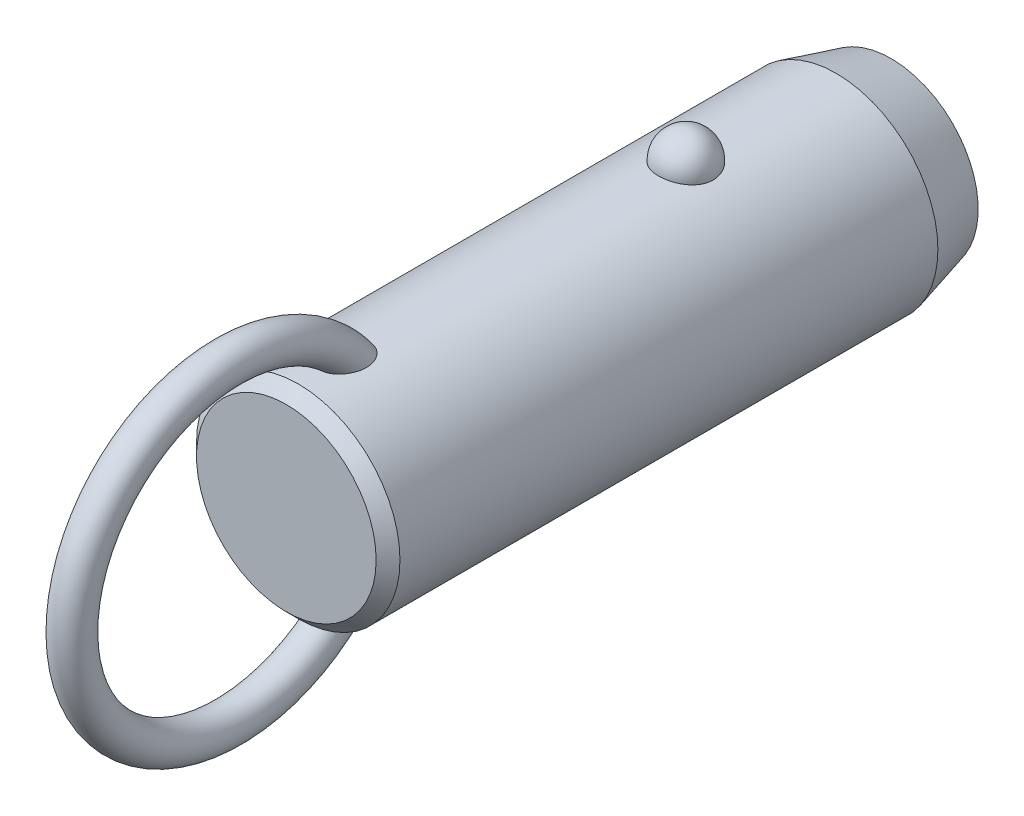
ISO-10303-21;
HEADER;
FILE_DESCRIPTION(('STEP AP214'),'2;1');
FILE_NAME('part.step','',(''),(''),'','','');
FILE_SCHEMA(('AUTOMOTIVE_DESIGN { 1 0 10303 214 1 1 1 1 }'));
ENDSEC;
DATA;
#1=APPLICATION_CONTEXT('core data for automotive mechanical design processes');
#2=APPLICATION_PROTOCOL_DEFINITION('international standard','automotive_design',2000,#1);
#3=PRODUCT_CONTEXT('',#1,'mechanical');
#4=PRODUCT('Part','Part','',(#3));
#5=PRODUCT_RELATED_PRODUCT_CATEGORY('part','',(#4));
#6=PRODUCT_DEFINITION_FORMATION('','',#4);
#7=PRODUCT_DEFINITION_CONTEXT('part definition',#1,'design');
#8=PRODUCT_DEFINITION('design','',#6,#7);
#9=PRODUCT_DEFINITION_SHAPE('','',#8);
#10=(LENGTH_UNIT() NAMED_UNIT(*) SI_UNIT(.MILLI.,.METRE.));
#11=(NAMED_UNIT(*) PLANE_ANGLE_UNIT() SI_UNIT($,.RADIAN.));
#12=(NAMED_UNIT(*) SI_UNIT($,.STERADIAN.) SOLID_ANGLE_UNIT());
#13=UNCERTAINTY_MEASURE_WITH_UNIT(LENGTH_MEASURE(1.E-05),#10,'distance_accuracy_value','');
#14=(GEOMETRIC_REPRESENTATION_CONTEXT(3) GLOBAL_UNCERTAINTY_ASSIGNED_CONTEXT((#13)) GLOBAL_UNIT_ASSIGNED_CONTEXT((#10,
#11,#12)) REPRESENTATION_CONTEXT('',''));
#15=CARTESIAN_POINT('',(0.,0.,0.));
#16=DIRECTION('',(0.,0.,1.));
#17=DIRECTION('',(1.,0.,0.));
#18=AXIS2_PLACEMENT_3D('',#15,#16,#17);
#19=CARTESIAN_POINT('',(0.,0.,27.9));
#20=DIRECTION('',(0.,0.,-1.));
#21=DIRECTION('',(-1.,0.,0.));
#22=AXIS2_PLACEMENT_3D('',#19,#20,#21);
#23=CYLINDRICAL_SURFACE('',#22,11.1);
#24=CARTESIAN_POINT('',(2.9724815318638,10.6945945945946,-3.00000000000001));
#25=CARTESIAN_POINT('',(2.9724783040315,10.6945972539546,-2.8322505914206));
#26=CARTESIAN_POINT('',(2.95876598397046,10.6984356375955,-2.66445972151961));
#27=CARTESIAN_POINT('',(2.90424529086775,10.7133624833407,-2.3336238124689));
#28=CARTESIAN_POINT('',(2.8634252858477,10.7244540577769,-2.17058084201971));
#29=CARTESIAN_POINT('',(2.75573657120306,10.7526272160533,-1.85396767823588));
#30=CARTESIAN_POINT('',(2.68887937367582,10.7697061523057,-1.70039333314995));
#31=CARTESIAN_POINT('',(2.53079696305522,10.8079438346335,-1.4069159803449));
#32=CARTESIAN_POINT('',(2.43957264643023,10.8291024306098,-1.26701246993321));
#33=CARTESIAN_POINT('',(2.23458150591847,10.8732541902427,-1.00409565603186));
#34=CARTESIAN_POINT('',(2.12071295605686,10.8962553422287,-0.88116297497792));
#35=CARTESIAN_POINT('',(1.87365402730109,10.9414421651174,-0.656352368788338));
#36=CARTESIAN_POINT('',(1.74046358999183,10.9636278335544,-0.554474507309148));
#37=CARTESIAN_POINT('',(1.45872188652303,11.0046495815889,-0.374872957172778));
#38=CARTESIAN_POINT('',(1.31021276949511,11.0234944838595,-0.297085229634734));
#39=CARTESIAN_POINT('',(1.00170030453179,11.0557957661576,-0.167529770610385));
#40=CARTESIAN_POINT('',(0.841698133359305,11.0692526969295,-0.115759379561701));
#41=CARTESIAN_POINT('',(0.51760779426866,11.0890932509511,-0.040392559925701));
#42=CARTESIAN_POINT('',(0.353633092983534,11.0955916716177,-0.0163383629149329));
#43=CARTESIAN_POINT('',(0.0238420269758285,11.1011989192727,0.0044517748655));
#44=CARTESIAN_POINT('',(-0.141974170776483,11.1003084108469,0.00119017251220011));
#45=CARTESIAN_POINT('',(-0.468405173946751,11.0912990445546,-0.0323233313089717));
#46=CARTESIAN_POINT('',(-0.629059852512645,11.0832767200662,-0.0622147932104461));
#47=CARTESIAN_POINT('',(-0.942937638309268,11.0609962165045,-0.147645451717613));
#48=CARTESIAN_POINT('',(-1.09616062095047,11.0467379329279,-0.20318507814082));
#49=CARTESIAN_POINT('',(-1.39181061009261,11.0134071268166,-0.338752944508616));
#50=CARTESIAN_POINT('',(-1.53417383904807,10.9943086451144,-0.418913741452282));
#51=CARTESIAN_POINT('',(-1.80342160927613,10.9533667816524,-0.601448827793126));
#52=CARTESIAN_POINT('',(-1.9303046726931,10.9315231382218,-0.703825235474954));
#53=CARTESIAN_POINT('',(-2.16747598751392,10.887005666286,-0.93009164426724));
#54=CARTESIAN_POINT('',(-2.27742774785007,10.8643239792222,-1.05433291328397));
#55=CARTESIAN_POINT('',(-2.47517316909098,10.8209886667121,-1.31966633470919));
#56=CARTESIAN_POINT('',(-2.56296538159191,10.8003351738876,-1.46075958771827));
#57=CARTESIAN_POINT('',(-2.71500300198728,10.7631304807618,-1.75753646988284));
#58=CARTESIAN_POINT('',(-2.77898901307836,10.7466250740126,-1.91335887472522));
#59=CARTESIAN_POINT('',(-2.88046189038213,10.7198747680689,-2.23391529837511));
#60=CARTESIAN_POINT('',(-2.91794947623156,10.709629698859,-2.3986490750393));
#61=CARTESIAN_POINT('',(-2.96537819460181,10.6965949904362,-2.73165170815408));
#62=CARTESIAN_POINT('',(-2.97542891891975,10.693775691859,-2.89990378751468));
#63=CARTESIAN_POINT('',(-2.96804271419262,10.6958279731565,-3.23575286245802));
#64=CARTESIAN_POINT('',(-2.95060646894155,10.7006993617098,-3.4033498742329));
#65=CARTESIAN_POINT('',(-2.88883358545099,10.71753912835,-3.73233906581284));
#66=CARTESIAN_POINT('',(-2.84462026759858,10.7294749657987,-3.89375610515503));
#67=CARTESIAN_POINT('',(-2.73050447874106,10.7590797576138,-4.20667949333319));
#68=CARTESIAN_POINT('',(-2.66060103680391,10.7767489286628,-4.35818546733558));
#69=CARTESIAN_POINT('',(-2.49642559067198,10.8159599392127,-4.64785421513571));
#70=CARTESIAN_POINT('',(-2.40203047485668,10.8375211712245,-4.78594458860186));
#71=CARTESIAN_POINT('',(-2.19143488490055,10.8820570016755,-5.04410382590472));
#72=CARTESIAN_POINT('',(-2.07523364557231,10.9050316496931,-5.16417205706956));
#73=CARTESIAN_POINT('',(-1.82361254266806,10.9499219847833,-5.3833483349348));
#74=CARTESIAN_POINT('',(-1.68812945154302,10.9718338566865,-5.48238464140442));
#75=CARTESIAN_POINT('',(-1.40191298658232,11.0120611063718,-5.65618873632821));
#76=CARTESIAN_POINT('',(-1.25118062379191,11.0303767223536,-5.73095813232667));
#77=CARTESIAN_POINT('',(-0.940570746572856,11.0611653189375,-5.85334725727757));
#78=CARTESIAN_POINT('',(-0.780821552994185,11.0737044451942,-5.90127578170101));
#79=CARTESIAN_POINT('',(-0.455204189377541,11.0918598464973,-5.9699297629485));
#80=CARTESIAN_POINT('',(-0.289336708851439,11.0974768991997,-5.99065827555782));
#81=CARTESIAN_POINT('',(0.0406846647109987,11.1011307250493,-6.00418773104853));
#82=CARTESIAN_POINT('',(0.204817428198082,11.099299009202,-5.99747318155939));
#83=CARTESIAN_POINT('',(0.5295530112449,11.088551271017,-5.95740317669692));
#84=CARTESIAN_POINT('',(0.690155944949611,11.0796354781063,-5.92404858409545));
#85=CARTESIAN_POINT('',(1.0027760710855,11.0557204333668,-5.83180084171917));
#86=CARTESIAN_POINT('',(1.15482001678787,11.0407414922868,-5.7729929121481));
#87=CARTESIAN_POINT('',(1.44678373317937,11.0062913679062,-5.63147366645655));
#88=CARTESIAN_POINT('',(1.58670279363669,10.9868199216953,-5.54876095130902));
#89=CARTESIAN_POINT('',(1.8527023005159,10.9451315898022,-5.36027644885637));
#90=CARTESIAN_POINT('',(1.97855158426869,10.9228788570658,-5.25418644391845));
#91=CARTESIAN_POINT('',(2.21080872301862,10.8782509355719,-5.02251354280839));
#92=CARTESIAN_POINT('',(2.31721312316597,10.8558757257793,-4.89692718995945));
#93=CARTESIAN_POINT('',(2.50945517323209,10.8130715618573,-4.62745408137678));
#94=CARTESIAN_POINT('',(2.59493284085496,10.7926798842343,-4.48330448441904));
#95=CARTESIAN_POINT('',(2.740862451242,10.7565495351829,-4.18236358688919));
#96=CARTESIAN_POINT('',(2.80132490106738,10.7408089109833,-4.02557762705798));
#97=CARTESIAN_POINT('',(2.88959070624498,10.7173718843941,-3.72475308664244));
#98=CARTESIAN_POINT('',(2.92062102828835,10.7088950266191,-3.58171216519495));
#99=CARTESIAN_POINT('',(2.96206765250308,10.6975052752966,-3.29245795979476));
#100=CARTESIAN_POINT('',(2.97248434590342,10.6945922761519,-3.14624473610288));
#101=CARTESIAN_POINT('',(2.9724815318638,10.6945945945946,-3.00000000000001));
#102=B_SPLINE_CURVE_WITH_KNOTS('',3,(#24,#25,#26,#27,#28,#29,#30,#31,#32,#33,#34,#35,#36,#37,
#38,#39,#40,#41,#42,#43,#44,#45,#46,#47,#48,#49,#50,#51,#52,#53,#54,#55,#56,#57,#58,#59,#60,#61,
#62,#63,#64,#65,#66,#67,#68,#69,#70,#71,#72,#73,#74,#75,#76,#77,#78,#79,#80,#81,#82,#83,#84,#85,
#86,#87,#88,#89,#90,#91,#92,#93,#94,#95,#96,#97,#98,#99,#100,#101),.UNSPECIFIED.,.T.,.F.,(4,2,2,
2,2,2,2,2,2,2,2,2,2,2,2,2,2,2,2,2,2,2,2,2,2,2,2,2,2,2,2,2,2,2,2,2,2,2,4),(0.,0.502722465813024,
1.00566079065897,1.5083769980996,2.01107471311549,2.51608392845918,3.02109467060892,
3.52475118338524,4.02835620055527,4.52351860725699,5.0186364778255,5.50715297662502,
5.99567766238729,6.48688002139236,6.97812923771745,7.47814366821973,7.97819077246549,
8.48353712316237,8.98886974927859,9.49218093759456,9.99547960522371,10.4964777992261,
10.997494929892,11.5010810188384,12.0046847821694,12.5099796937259,13.0152411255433,
13.5145635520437,14.0138298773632,14.5043200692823,14.9947943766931,15.4836390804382,
15.9725123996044,16.4685040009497,16.9645836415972,17.4686765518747,17.972557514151,
18.410841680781,18.849117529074),.UNSPECIFIED.);
#103=CARTESIAN_POINT('',(2.9724815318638,10.6945945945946,-3.00000000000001));
#104=VERTEX_POINT('',#103);
#105=EDGE_CURVE('E41',#104,#104,#102,.T.);
#106=ORIENTED_EDGE('',*,*,#105,.T.);
#107=EDGE_LOOP('',(#106));
#108=FACE_BOUND('',#107,.T.);
#109=CARTESIAN_POINT('',(0.,0.,39.3));
#110=DIRECTION('',(0.,0.,1.));
#111=DIRECTION('',(1.,0.,0.));
#112=AXIS2_PLACEMENT_3D('',#109,#110,#111);
#113=CIRCLE('',#112,11.1);
#114=CARTESIAN_POINT('',(11.1,0.,39.3));
#115=VERTEX_POINT('',#114);
#116=EDGE_CURVE('E10',#115,#115,#113,.F.);
#117=ORIENTED_EDGE('',*,*,#116,.T.);
#118=EDGE_LOOP('',(#117));
#119=FACE_BOUND('',#118,.T.);
#120=CARTESIAN_POINT('',(-0.564520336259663,-11.0856356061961,31.557815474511));
#121=CARTESIAN_POINT('',(-0.667202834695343,-11.0804062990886,31.5912839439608));
#122=CARTESIAN_POINT('',(-0.766875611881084,-11.0738877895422,31.6338357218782));
#123=CARTESIAN_POINT('',(-0.957284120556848,-11.0590576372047,31.7354190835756));
#124=CARTESIAN_POINT('',(-1.04801616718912,-11.0507452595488,31.7944574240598));
#125=CARTESIAN_POINT('',(-1.21800952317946,-11.0333016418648,31.9265293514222));
#126=CARTESIAN_POINT('',(-1.29730805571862,-11.0241732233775,31.9995156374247));
#127=CARTESIAN_POINT('',(-1.44337665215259,-11.0060026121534,32.1570374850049));
#128=CARTESIAN_POINT('',(-1.51014622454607,-10.9969604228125,32.2415734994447));
#129=CARTESIAN_POINT('',(-1.63454620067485,-10.9791841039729,32.4255213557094));
#130=CARTESIAN_POINT('',(-1.69127003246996,-10.9705107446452,32.5255493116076));
#131=CARTESIAN_POINT('',(-1.78980785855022,-10.9548648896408,32.7327902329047));
#132=CARTESIAN_POINT('',(-1.83161214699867,-10.9478935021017,32.8400078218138));
#133=CARTESIAN_POINT('',(-1.91557028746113,-10.9335803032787,33.1054080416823));
#134=CARTESIAN_POINT('',(-1.95040620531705,-10.9273269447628,33.2659806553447));
#135=CARTESIAN_POINT('',(-1.99388326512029,-10.9194709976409,33.5906977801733));
#136=CARTESIAN_POINT('',(-2.00248051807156,-10.9178762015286,33.7548478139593));
#137=CARTESIAN_POINT('',(-1.99551615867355,-10.9191578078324,34.1246504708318));
#138=CARTESIAN_POINT('',(-1.9732206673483,-10.9232807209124,34.3301911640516));
#139=CARTESIAN_POINT('',(-1.9152976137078,-10.9335244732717,34.633595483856));
#140=CARTESIAN_POINT('',(-1.89184575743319,-10.9376266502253,34.7340883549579));
#141=CARTESIAN_POINT('',(-1.83700674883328,-10.9469720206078,34.932855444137));
#142=CARTESIAN_POINT('',(-1.80562070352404,-10.9522150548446,35.0311299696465));
#143=CARTESIAN_POINT('',(-1.73463055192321,-10.9636837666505,35.2259148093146));
#144=CARTESIAN_POINT('',(-1.69493416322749,-10.9699202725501,35.3223907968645));
#145=CARTESIAN_POINT('',(-1.60745141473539,-10.9830806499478,35.5116262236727));
#146=CARTESIAN_POINT('',(-1.55966150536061,-10.9900048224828,35.6043840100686));
#147=CARTESIAN_POINT('',(-1.45591812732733,-11.0042280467,35.7846907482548));
#148=CARTESIAN_POINT('',(-1.40000013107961,-11.0115253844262,35.8722601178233));
#149=CARTESIAN_POINT('',(-1.2793747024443,-11.0261911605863,36.041029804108));
#150=CARTESIAN_POINT('',(-1.21467835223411,-11.0335594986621,36.1222379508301));
#151=CARTESIAN_POINT('',(-1.08218150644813,-11.0473027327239,36.2690010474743));
#152=CARTESIAN_POINT('',(-1.01522633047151,-11.0537063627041,36.3353092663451));
#153=CARTESIAN_POINT('',(-0.872952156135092,-11.065850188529,36.4583780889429));
#154=CARTESIAN_POINT('',(-0.79764242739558,-11.0715911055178,36.5151491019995));
#155=CARTESIAN_POINT('',(-0.651396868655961,-11.081071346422,36.6075155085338));
#156=CARTESIAN_POINT('',(-0.58171263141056,-11.0849841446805,36.6450491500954));
#157=CARTESIAN_POINT('',(-0.437066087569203,-11.0916271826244,36.7082594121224));
#158=CARTESIAN_POINT('',(-0.362109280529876,-11.0943586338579,36.7339481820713));
#159=CARTESIAN_POINT('',(-0.20782800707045,-11.0983242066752,36.771117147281));
#160=CARTESIAN_POINT('',(-0.128467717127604,-11.0995432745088,36.7824545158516));
#161=CARTESIAN_POINT('',(0.0309101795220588,-11.1002423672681,36.7889658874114));
#162=CARTESIAN_POINT('',(0.110927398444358,-11.0997233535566,36.7841488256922));
#163=CARTESIAN_POINT('',(0.256406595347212,-11.097240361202,36.7609599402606));
#164=CARTESIAN_POINT('',(0.322235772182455,-11.0955074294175,36.7447543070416));
#165=CARTESIAN_POINT('',(0.450635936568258,-11.0910350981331,36.7026008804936));
#166=CARTESIAN_POINT('',(0.513205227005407,-11.0882951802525,36.6766480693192));
#167=CARTESIAN_POINT('',(0.662626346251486,-11.0805620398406,36.6026073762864));
#168=CARTESIAN_POINT('',(0.747127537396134,-11.0751144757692,36.5498452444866));
#169=CARTESIAN_POINT('',(0.906756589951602,-11.0631932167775,36.4317206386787));
#170=CARTESIAN_POINT('',(0.981859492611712,-11.0567168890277,36.3663257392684));
#171=CARTESIAN_POINT('',(1.1071220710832,-11.0447856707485,36.2422633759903));
#172=CARTESIAN_POINT('',(1.15909566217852,-11.0394280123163,36.1853831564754));
#173=CARTESIAN_POINT('',(1.25791923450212,-11.0286040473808,36.0673271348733));
#174=CARTESIAN_POINT('',(1.30476642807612,-11.0231376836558,36.0061490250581));
#175=CARTESIAN_POINT('',(1.43818612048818,-11.0068027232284,35.817305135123));
#176=CARTESIAN_POINT('',(1.51751767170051,-10.9960104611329,35.6844531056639));
#177=CARTESIAN_POINT('',(1.63597546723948,-10.9788847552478,35.4531371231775));
#178=CARTESIAN_POINT('',(1.67988876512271,-10.9722190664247,35.3570530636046));
#179=CARTESIAN_POINT('',(1.75953241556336,-10.9597298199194,35.1614311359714));
#180=CARTESIAN_POINT('',(1.79525967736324,-10.9539065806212,35.0618919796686));
#181=CARTESIAN_POINT('',(1.85844731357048,-10.9433632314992,34.8602111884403));
#182=CARTESIAN_POINT('',(1.88591073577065,-10.9386427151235,34.7580705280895));
#183=CARTESIAN_POINT('',(1.93234324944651,-10.9305350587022,34.551819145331));
#184=CARTESIAN_POINT('',(1.95131065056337,-10.9271481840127,34.4477080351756));
#185=CARTESIAN_POINT('',(1.99040203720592,-10.9201183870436,34.1654588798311));
#186=CARTESIAN_POINT('',(2.00221217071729,-10.9179256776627,33.9860370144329));
#187=CARTESIAN_POINT('',(1.99711676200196,-10.9188636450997,33.6277133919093));
#188=CARTESIAN_POINT('',(1.98026150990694,-10.9219849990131,33.4488112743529));
#189=CARTESIAN_POINT('',(1.92151657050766,-10.9324473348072,33.1364514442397));
#190=CARTESIAN_POINT('',(1.88605081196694,-10.9386915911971,33.0017594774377));
#191=CARTESIAN_POINT('',(1.79393020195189,-10.9541780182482,32.7399669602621));
#192=CARTESIAN_POINT('',(1.73729868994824,-10.9634168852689,32.6128582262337));
#193=CARTESIAN_POINT('',(1.61237037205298,-10.9824218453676,32.3894184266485));
#194=CARTESIAN_POINT('',(1.54715374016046,-10.9918945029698,32.2913455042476));
#195=CARTESIAN_POINT('',(1.40127026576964,-11.0114415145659,32.1074341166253));
#196=CARTESIAN_POINT('',(1.32060742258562,-11.0215157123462,32.0215924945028));
#197=CARTESIAN_POINT('',(1.14474787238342,-11.041168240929,31.8651630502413));
#198=CARTESIAN_POINT('',(1.04947805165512,-11.0507437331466,31.7946565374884));
#199=CARTESIAN_POINT('',(0.847278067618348,-11.0680789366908,31.672640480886));
#200=CARTESIAN_POINT('',(0.740351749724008,-11.0758392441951,31.6211246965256));
#201=CARTESIAN_POINT('',(0.529289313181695,-11.0878275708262,31.5434852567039));
#202=CARTESIAN_POINT('',(0.425895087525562,-11.0923259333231,31.515377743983));
#203=CARTESIAN_POINT('',(0.215723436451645,-11.0984001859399,31.4777038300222));
#204=CARTESIAN_POINT('',(0.108947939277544,-11.0999777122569,31.4681270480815));
#205=CARTESIAN_POINT('',(-0.0938962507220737,-11.1000196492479,31.4678773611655));
#206=CARTESIAN_POINT('',(-0.189967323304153,-11.0987797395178,31.4754089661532));
#207=CARTESIAN_POINT('',(-0.379657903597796,-11.0939111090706,31.5055079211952));
#208=CARTESIAN_POINT('',(-0.473277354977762,-11.0902823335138,31.5280756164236));
#209=CARTESIAN_POINT('',(-0.564520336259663,-11.0856356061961,31.557815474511));
#210=B_SPLINE_CURVE_WITH_KNOTS('',3,(#120,#121,#122,#123,#124,#125,#126,#127,#128,#129,#130,
#131,#132,#133,#134,#135,#136,#137,#138,#139,#140,#141,#142,#143,#144,#145,#146,#147,#148,#149,
#150,#151,#152,#153,#154,#155,#156,#157,#158,#159,#160,#161,#162,#163,#164,#165,#166,#167,#168,
#169,#170,#171,#172,#173,#174,#175,#176,#177,#178,#179,#180,#181,#182,#183,#184,#185,#186,#187,
#188,#189,#190,#191,#192,#193,#194,#195,#196,#197,#198,#199,#200,#201,#202,#203,#204,#205,#206,
#207,#208,#209),.UNSPECIFIED.,.T.,.F.,(4,2,2,2,2,2,2,2,2,2,2,2,2,2,2,2,2,2,2,2,2,2,2,2,2,2,2,2,
2,2,2,2,2,2,2,2,2,2,2,2,2,2,2,2,4),(0.,0.323999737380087,0.64813245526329,0.971184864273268,
1.29424994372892,1.6388623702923,1.98369857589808,2.4742605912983,2.96564271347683,
3.58257396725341,3.89215258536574,4.20168803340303,4.51486273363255,4.8281751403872,
5.14015911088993,5.45175282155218,5.734428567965,6.01679375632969,6.25364580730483,
6.49025437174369,6.72919963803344,6.9680127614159,7.17061258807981,7.37331685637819,
7.67094989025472,7.96935728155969,8.20075067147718,8.43226927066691,8.8958162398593,
9.21306533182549,9.53043400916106,9.84768549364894,10.1650000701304,10.70229304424,
11.2386443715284,11.6553390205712,12.0715755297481,12.4245637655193,12.7774607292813,
13.1321855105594,13.4867936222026,13.8068771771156,14.1267813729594,14.4146787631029,
14.7025827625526),.UNSPECIFIED.);
#211=CARTESIAN_POINT('',(-0.564520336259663,-11.0856356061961,31.557815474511));
#212=VERTEX_POINT('',#211);
#213=EDGE_CURVE('E59',#212,#212,#210,.T.);
#214=ORIENTED_EDGE('',*,*,#213,.T.);
#215=EDGE_LOOP('',(#214));
#216=FACE_BOUND('',#215,.T.);
#217=CARTESIAN_POINT('',(-0.564520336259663,11.0856356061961,31.557815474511));
#218=CARTESIAN_POINT('',(-0.468542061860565,11.0905203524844,31.5265456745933));
#219=CARTESIAN_POINT('',(-0.369793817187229,11.0942886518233,31.5031576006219));
#220=CARTESIAN_POINT('',(-0.169555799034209,11.0991586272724,31.4730858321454));
#221=CARTESIAN_POINT('',(-0.0680604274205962,11.1002543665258,31.4664393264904));
#222=CARTESIAN_POINT('',(0.13454973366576,11.099646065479,31.4701579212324));
#223=CARTESIAN_POINT('',(0.235664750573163,11.0979441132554,31.4805103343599));
#224=CARTESIAN_POINT('',(0.434632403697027,11.0919342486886,31.5178318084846));
#225=CARTESIAN_POINT('',(0.532486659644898,11.0876276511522,31.5447924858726));
#226=CARTESIAN_POINT('',(0.722445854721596,11.0768742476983,31.6144096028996));
#227=CARTESIAN_POINT('',(0.814543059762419,11.0704246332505,31.6570866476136));
#228=CARTESIAN_POINT('',(0.99056508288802,11.0560659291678,31.7566487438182));
#229=CARTESIAN_POINT('',(1.07448844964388,11.048156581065,31.8135363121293));
#230=CARTESIAN_POINT('',(1.23562672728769,11.0313221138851,31.9422106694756));
#231=CARTESIAN_POINT('',(1.31242684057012,11.0223686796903,32.0145117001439));
#232=CARTESIAN_POINT('',(1.45398030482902,11.0045918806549,32.1700425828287));
#233=CARTESIAN_POINT('',(1.51873073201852,10.9957685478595,32.2532750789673));
#234=CARTESIAN_POINT('',(1.64107232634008,10.9782087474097,32.4363842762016));
#235=CARTESIAN_POINT('',(1.6974317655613,10.9695572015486,32.5370893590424));
#236=CARTESIAN_POINT('',(1.79515063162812,10.9539887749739,32.7456264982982));
#237=CARTESIAN_POINT('',(1.83649966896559,10.9470730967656,32.8534634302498));
#238=CARTESIAN_POINT('',(1.91931148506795,10.9329211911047,33.1203995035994));
#239=CARTESIAN_POINT('',(1.9534010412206,10.9267904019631,33.2818612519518));
#240=CARTESIAN_POINT('',(1.99526195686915,10.9192174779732,33.6082163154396));
#241=CARTESIAN_POINT('',(2.00298989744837,10.9177830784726,33.7731148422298));
#242=CARTESIAN_POINT('',(1.99396251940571,10.9194420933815,34.1441006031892));
#243=CARTESIAN_POINT('',(1.97050829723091,10.923774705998,34.3500387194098));
#244=CARTESIAN_POINT('',(1.91079643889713,10.9343131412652,34.6539019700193));
#245=CARTESIAN_POINT('',(1.8867370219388,10.9385106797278,34.7545296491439));
#246=CARTESIAN_POINT('',(1.83065508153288,10.9480376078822,34.9535107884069));
#247=CARTESIAN_POINT('',(1.79863369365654,10.9533668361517,35.051864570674));
#248=CARTESIAN_POINT('',(1.72633365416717,10.9649954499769,35.2467203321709));
#249=CARTESIAN_POINT('',(1.68596409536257,10.9713053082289,35.3431879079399));
#250=CARTESIAN_POINT('',(1.5970799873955,10.9845964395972,35.5323233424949));
#251=CARTESIAN_POINT('',(1.54856169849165,10.9915780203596,35.6249894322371));
#252=CARTESIAN_POINT('',(1.44330168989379,11.0058935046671,35.8049752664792));
#253=CARTESIAN_POINT('',(1.38659749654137,11.0132257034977,35.892316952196));
#254=CARTESIAN_POINT('',(1.26431158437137,11.0279330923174,36.0604563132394));
#255=CARTESIAN_POINT('',(1.19874160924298,11.0353082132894,36.1412624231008));
#256=CARTESIAN_POINT('',(1.06542088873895,11.048931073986,36.2859856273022));
#257=CARTESIAN_POINT('',(0.998640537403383,11.0552153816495,36.350784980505));
#258=CARTESIAN_POINT('',(0.856896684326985,11.0671032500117,36.4708462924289));
#259=CARTESIAN_POINT('',(0.781942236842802,11.0727075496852,36.5261186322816));
#260=CARTESIAN_POINT('',(0.636276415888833,11.081949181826,36.6159721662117));
#261=CARTESIAN_POINT('',(0.566755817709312,11.0857572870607,36.6524410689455));
#262=CARTESIAN_POINT('',(0.422602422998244,11.0921860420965,36.7135333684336));
#263=CARTESIAN_POINT('',(0.34797497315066,11.0948079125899,36.7381689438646));
#264=CARTESIAN_POINT('',(0.194593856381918,11.0985608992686,36.7733233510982));
#265=CARTESIAN_POINT('',(0.115807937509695,11.0996777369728,36.7837069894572));
#266=CARTESIAN_POINT('',(-0.0422499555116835,11.1002003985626,36.7885747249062));
#267=CARTESIAN_POINT('',(-0.12152169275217,11.09960699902,36.783066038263));
#268=CARTESIAN_POINT('',(-0.266046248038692,11.0970123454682,36.7588271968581));
#269=CARTESIAN_POINT('',(-0.331661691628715,11.0952283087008,36.7421356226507));
#270=CARTESIAN_POINT('',(-0.459588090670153,11.0906663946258,36.6991117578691));
#271=CARTESIAN_POINT('',(-0.521897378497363,11.0878880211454,36.672774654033));
#272=CARTESIAN_POINT('',(-0.671446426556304,11.0800342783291,36.5975130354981));
#273=CARTESIAN_POINT('',(-0.756250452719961,11.0744969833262,36.5438182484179));
#274=CARTESIAN_POINT('',(-0.916349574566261,11.0624045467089,36.4238029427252));
#275=CARTESIAN_POINT('',(-0.991618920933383,11.0558467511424,36.3574493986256));
#276=CARTESIAN_POINT('',(-1.11713140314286,11.0437783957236,36.2316335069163));
#277=CARTESIAN_POINT('',(-1.16920539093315,11.0383619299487,36.1739524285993));
#278=CARTESIAN_POINT('',(-1.26817476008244,11.02743010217,36.0542809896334));
#279=CARTESIAN_POINT('',(-1.31506731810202,11.0219146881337,35.9922883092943));
#280=CARTESIAN_POINT('',(-1.40399813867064,11.0109399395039,35.8647843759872));
#281=CARTESIAN_POINT('',(-1.44602864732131,11.0054807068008,35.7992677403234));
#282=CARTESIAN_POINT('',(-1.52538779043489,10.9947621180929,35.6654223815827));
#283=CARTESIAN_POINT('',(-1.56271516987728,10.9895028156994,35.5970929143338));
#284=CARTESIAN_POINT('',(-1.64537943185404,10.9774790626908,35.4332101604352));
#285=CARTESIAN_POINT('',(-1.6887949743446,10.9708503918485,35.3366735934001));
#286=CARTESIAN_POINT('',(-1.76740738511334,10.9584602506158,35.1402369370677));
#287=CARTESIAN_POINT('',(-1.80260120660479,10.95269910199,35.0403356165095));
#288=CARTESIAN_POINT('',(-1.86468657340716,10.9423003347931,34.8379663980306));
#289=CARTESIAN_POINT('',(-1.89158164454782,10.9376622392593,34.7354996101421));
#290=CARTESIAN_POINT('',(-1.9368245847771,10.9297405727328,34.5286429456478));
#291=CARTESIAN_POINT('',(-1.9551708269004,10.9264572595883,34.424252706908));
#292=CARTESIAN_POINT('',(-1.99232562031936,10.9197647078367,34.1426287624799));
#293=CARTESIAN_POINT('',(-2.00294603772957,10.9177914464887,33.9641857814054));
#294=CARTESIAN_POINT('',(-1.99566675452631,10.9191290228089,33.6079962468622));
#295=CARTESIAN_POINT('',(-1.97781651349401,10.9224306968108,33.4302490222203));
#296=CARTESIAN_POINT('',(-1.91747214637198,10.93315926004,33.1197921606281));
#297=CARTESIAN_POINT('',(-1.88131022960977,10.9395108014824,32.9858251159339));
#298=CARTESIAN_POINT('',(-1.7879038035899,10.9551659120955,32.7255975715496));
#299=CARTESIAN_POINT('',(-1.73068309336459,10.9644661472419,32.5993285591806));
#300=CARTESIAN_POINT('',(-1.60475573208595,10.9835398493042,32.3774156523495));
#301=CARTESIAN_POINT('',(-1.53908879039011,10.9930297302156,32.2800265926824));
#302=CARTESIAN_POINT('',(-1.39238608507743,11.0125708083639,32.0975250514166));
#303=CARTESIAN_POINT('',(-1.31135150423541,11.0226219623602,32.0124116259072));
#304=CARTESIAN_POINT('',(-1.14382035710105,11.0411991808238,31.8652994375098));
#305=CARTESIAN_POINT('',(-1.05858500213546,11.0497792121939,31.8018693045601));
#306=CARTESIAN_POINT('',(-0.878723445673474,11.0655285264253,31.6902505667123));
#307=CARTESIAN_POINT('',(-0.784123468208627,11.0727015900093,31.6420208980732));
#308=CARTESIAN_POINT('',(-0.646163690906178,11.0812501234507,31.586023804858));
#309=CARTESIAN_POINT('',(-0.605595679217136,11.0835451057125,31.5711978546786));
#310=CARTESIAN_POINT('',(-0.564520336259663,11.0856356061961,31.557815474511));
#311=B_SPLINE_CURVE_WITH_KNOTS('',3,(#217,#218,#219,#220,#221,#222,#223,#224,#225,#226,#227,
#228,#229,#230,#231,#232,#233,#234,#235,#236,#237,#238,#239,#240,#241,#242,#243,#244,#245,#246,
#247,#248,#249,#250,#251,#252,#253,#254,#255,#256,#257,#258,#259,#260,#261,#262,#263,#264,#265,
#266,#267,#268,#269,#270,#271,#272,#273,#274,#275,#276,#277,#278,#279,#280,#281,#282,#283,#284,
#285,#286,#287,#288,#289,#290,#291,#292,#293,#294,#295,#296,#297,#298,#299,#300,#301,#302,#303,
#304,#305,#306,#307,#308,#309,#310),.UNSPECIFIED.,.T.,.F.,(4,2,2,2,2,2,2,2,2,2,2,2,2,2,2,2,2,2,
2,2,2,2,2,2,2,2,2,2,2,2,2,2,2,2,2,2,2,2,2,2,2,2,2,2,2,2,4),(0.,0.303061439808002,
0.606795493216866,0.910302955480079,1.21365733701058,1.51741085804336,1.82121821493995,
2.13745205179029,2.45376252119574,2.799586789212,3.14564996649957,3.63832391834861,
4.13180893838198,4.7503191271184,5.06071926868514,5.37107516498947,5.68500772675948,
5.99908475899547,6.31176519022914,6.62403542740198,6.90315673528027,7.1819719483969,
7.4168777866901,7.65154134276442,7.88841587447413,8.12518286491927,8.3275284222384,
8.52997509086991,8.82986421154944,9.13054668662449,9.36393502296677,9.59744991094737,
9.83133221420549,10.0652767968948,10.383032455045,10.7009056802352,11.0186436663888,
11.3364420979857,11.8705925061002,12.4038159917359,12.8189662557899,13.2336487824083,
13.5857049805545,13.9377340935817,14.2561354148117,14.5736690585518,14.7033687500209),.UNSPECIFIED.);
#312=CARTESIAN_POINT('',(-0.564520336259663,11.0856356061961,31.557815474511));
#313=VERTEX_POINT('',#312);
#314=EDGE_CURVE('E67',#313,#313,#311,.T.);
#315=ORIENTED_EDGE('',*,*,#314,.T.);
#316=EDGE_LOOP('',(#315));
#317=FACE_BOUND('',#316,.T.);
#318=CARTESIAN_POINT('',(0.,0.,-19.3999999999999));
#319=DIRECTION('',(0.,0.,-1.));
#320=DIRECTION('',(-1.,0.,0.));
#321=AXIS2_PLACEMENT_3D('',#318,#319,#320);
#322=CIRCLE('',#321,11.1);
#323=CARTESIAN_POINT('',(-11.1,0.,-19.3999999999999));
#324=VERTEX_POINT('',#323);
#325=EDGE_CURVE('E56',#324,#324,#322,.F.);
#326=ORIENTED_EDGE('',*,*,#325,.T.);
#327=EDGE_LOOP('',(#326));
#328=FACE_BOUND('',#327,.T.);
#329=ADVANCED_FACE('F37',(#108,#119,#216,#317,#328),#23,.T.);
#330=CARTESIAN_POINT('',(0.,0.,-25.4));
#331=DIRECTION('',(0.,0.,-1.));
#332=DIRECTION('',(-1.,0.,0.));
#333=AXIS2_PLACEMENT_3D('',#330,#331,#332);
#334=PLANE('',#333);
#335=CARTESIAN_POINT('',(0.,0.,-25.4));
#336=DIRECTION('',(0.,0.,-1.));
#337=DIRECTION('',(-1.,0.,0.));
#338=AXIS2_PLACEMENT_3D('',#335,#336,#337);
#339=CIRCLE('',#338,9.49230484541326);
#340=CARTESIAN_POINT('',(-9.49230484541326,0.,-25.4));
#341=VERTEX_POINT('',#340);
#342=EDGE_CURVE('E66',#341,#341,#339,.T.);
#343=ORIENTED_EDGE('',*,*,#342,.T.);
#344=EDGE_LOOP('',(#343));
#345=FACE_BOUND('',#344,.T.);
#346=ADVANCED_FACE('F85',(#345),#334,.T.);
#347=CARTESIAN_POINT('',(0.,0.,-25.4));
#348=DIRECTION('',(0.,0.,1.));
#349=DIRECTION('',(1.,0.,0.));
#350=AXIS2_PLACEMENT_3D('',#347,#348,#349);
#351=CONICAL_SURFACE('',#350,9.49230484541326,0.261799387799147);
#352=ORIENTED_EDGE('',*,*,#325,.F.);
#353=EDGE_LOOP('',(#352));
#354=FACE_BOUND('',#353,.T.);
#355=ORIENTED_EDGE('',*,*,#342,.F.);
#356=EDGE_LOOP('',(#355));
#357=FACE_BOUND('',#356,.T.);
#358=ADVANCED_FACE('F83',(#354,#357),#351,.T.);
#359=CARTESIAN_POINT('',(0.,0.,40.6));
#360=DIRECTION('',(0.,0.,1.));
#361=DIRECTION('',(1.,0.,0.));
#362=AXIS2_PLACEMENT_3D('',#359,#360,#361);
#363=PLANE('',#362);
#364=CARTESIAN_POINT('',(0.,0.,40.6));
#365=DIRECTION('',(0.,0.,1.));
#366=DIRECTION('',(1.,0.,0.));
#367=AXIS2_PLACEMENT_3D('',#364,#365,#366);
#368=CIRCLE('',#367,9.79999999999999);
#369=CARTESIAN_POINT('',(9.79999999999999,0.,40.6));
#370=VERTEX_POINT('',#369);
#371=EDGE_CURVE('E50',#370,#370,#368,.T.);
#372=ORIENTED_EDGE('',*,*,#371,.T.);
#373=EDGE_LOOP('',(#372));
#374=FACE_BOUND('',#373,.T.);
#375=ADVANCED_FACE('F77',(#374),#363,.T.);
#376=CARTESIAN_POINT('',(0.,0.,46.95));
#377=DIRECTION('',(1.,0.,0.));
#378=DIRECTION('',(0.,0.,-1.));
#379=AXIS2_PLACEMENT_3D('',#376,#377,#378);
#380=TOROIDAL_SURFACE('',#379,17.05,2.);
#381=ORIENTED_EDGE('',*,*,#314,.F.);
#382=EDGE_LOOP('',(#381));
#383=FACE_BOUND('',#382,.T.);
#384=ORIENTED_EDGE('',*,*,#213,.F.);
#385=EDGE_LOOP('',(#384));
#386=FACE_BOUND('',#385,.T.);
#387=ADVANCED_FACE('F73',(#383,#386),#380,.T.);
#388=CARTESIAN_POINT('',(0.,0.,40.6));
#389=DIRECTION('',(0.,0.,-1.));
#390=DIRECTION('',(-1.,0.,0.));
#391=AXIS2_PLACEMENT_3D('',#388,#389,#390);
#392=CONICAL_SURFACE('',#391,9.79999999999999,0.785398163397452);
#393=ORIENTED_EDGE('',*,*,#116,.F.);
#394=EDGE_LOOP('',(#393));
#395=FACE_BOUND('',#394,.T.);
#396=ORIENTED_EDGE('',*,*,#371,.F.);
#397=EDGE_LOOP('',(#396));
#398=FACE_BOUND('',#397,.T.);
#399=ADVANCED_FACE('F39',(#395,#398),#392,.T.);
#400=CARTESIAN_POINT('',(0.,11.1,-3.00000000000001));
#401=DIRECTION('',(0.,1.,0.));
#402=DIRECTION('',(0.,0.,-1.));
#403=AXIS2_PLACEMENT_3D('',#400,#401,#402);
#404=SPHERICAL_SURFACE('',#403,3.);
#405=ORIENTED_EDGE('',*,*,#105,.F.);
#406=EDGE_LOOP('',(#405));
#407=FACE_BOUND('',#406,.T.);
#408=ADVANCED_FACE('F79',(#407),#404,.T.);
#409=CLOSED_SHELL('',(#329,#346,#358,#375,#387,#399,#408));
#410=MANIFOLD_SOLID_BREP('B2',#409);
#411=ADVANCED_BREP_SHAPE_REPRESENTATION('',(#18,#410),#14);
#412=SHAPE_DEFINITION_REPRESENTATION(#9,#411);
ENDSEC;
END-ISO-10303-21;
